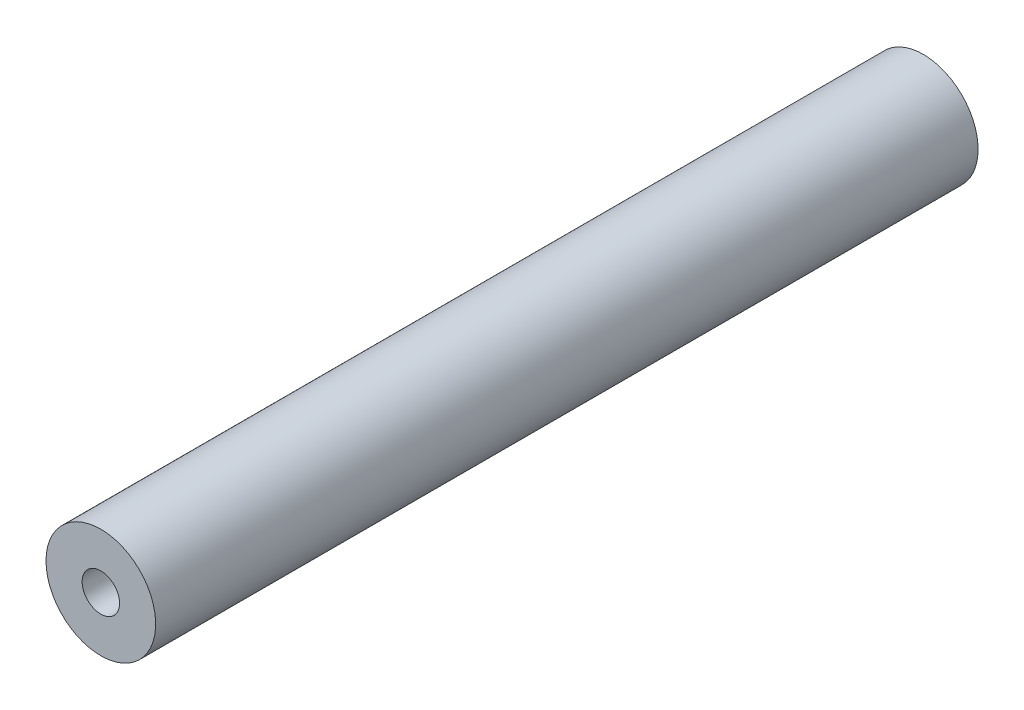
from build123d import *

# Parameters (mm, degrees)
ESBO_O1_R                                     = 3
RESSALTO_EXTRUS_O1_DEPTH                      = 45
BROCA_DE_ROSQUEAR_PARA_TARRAXA_DE_M2_51_D     = 2.05
BROCA_DE_ROSQUEAR_PARA_TARRAXA_DE_M2_51_DEPTH = 8
BROCA_DE_ROSQUEAR_PARA_TARRAXA_DE_M2_51_TIP   = 0.615882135
BROCA_DE_ROSQUEAR_PARA_TARRAXA_DE_M2_52_D     = 2.05
BROCA_DE_ROSQUEAR_PARA_TARRAXA_DE_M2_52_DEPTH = 8
BROCA_DE_ROSQUEAR_PARA_TARRAXA_DE_M2_52_TIP   = 0.615882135


with BuildPart() as part:
    # Esbo_o1 → Ressalto-extrus_o1 (new body)
    with BuildSketch(Plane.XY):
        with Locations(Location((0, 0, 0), (0, 0, 180))):
            Circle(ESBO_O1_R)
    extrude(amount=RESSALTO_EXTRUS_O1_DEPTH)

    # Broca de rosquear para tarraxa de M2.51
    with Locations(Plane.XY.offset(45)):
        with Locations((0, 0)):
            Hole(BROCA_DE_ROSQUEAR_PARA_TARRAXA_DE_M2_51_D / 2, depth=BROCA_DE_ROSQUEAR_PARA_TARRAXA_DE_M2_51_DEPTH)
            with Locations((0, 0, -(BROCA_DE_ROSQUEAR_PARA_TARRAXA_DE_M2_51_DEPTH + BROCA_DE_ROSQUEAR_PARA_TARRAXA_DE_M2_51_TIP / 2))):  # 118° drill point
                Cone(0, BROCA_DE_ROSQUEAR_PARA_TARRAXA_DE_M2_51_D / 2, BROCA_DE_ROSQUEAR_PARA_TARRAXA_DE_M2_51_TIP, mode=Mode.SUBTRACT)

    # Broca de rosquear para tarraxa de M2.52
    with Locations(Plane(origin=(0, 0, 0), x_dir=(-1, 0, 0), z_dir=(0, 0, -1))):
        with Locations((0, 0)):
            Hole(BROCA_DE_ROSQUEAR_PARA_TARRAXA_DE_M2_52_D / 2, depth=BROCA_DE_ROSQUEAR_PARA_TARRAXA_DE_M2_52_DEPTH)
            with Locations((0, 0, -(BROCA_DE_ROSQUEAR_PARA_TARRAXA_DE_M2_52_DEPTH + BROCA_DE_ROSQUEAR_PARA_TARRAXA_DE_M2_52_TIP / 2))):  # 118° drill point
                Cone(0, BROCA_DE_ROSQUEAR_PARA_TARRAXA_DE_M2_52_D / 2, BROCA_DE_ROSQUEAR_PARA_TARRAXA_DE_M2_52_TIP, mode=Mode.SUBTRACT)


solid = part.part
